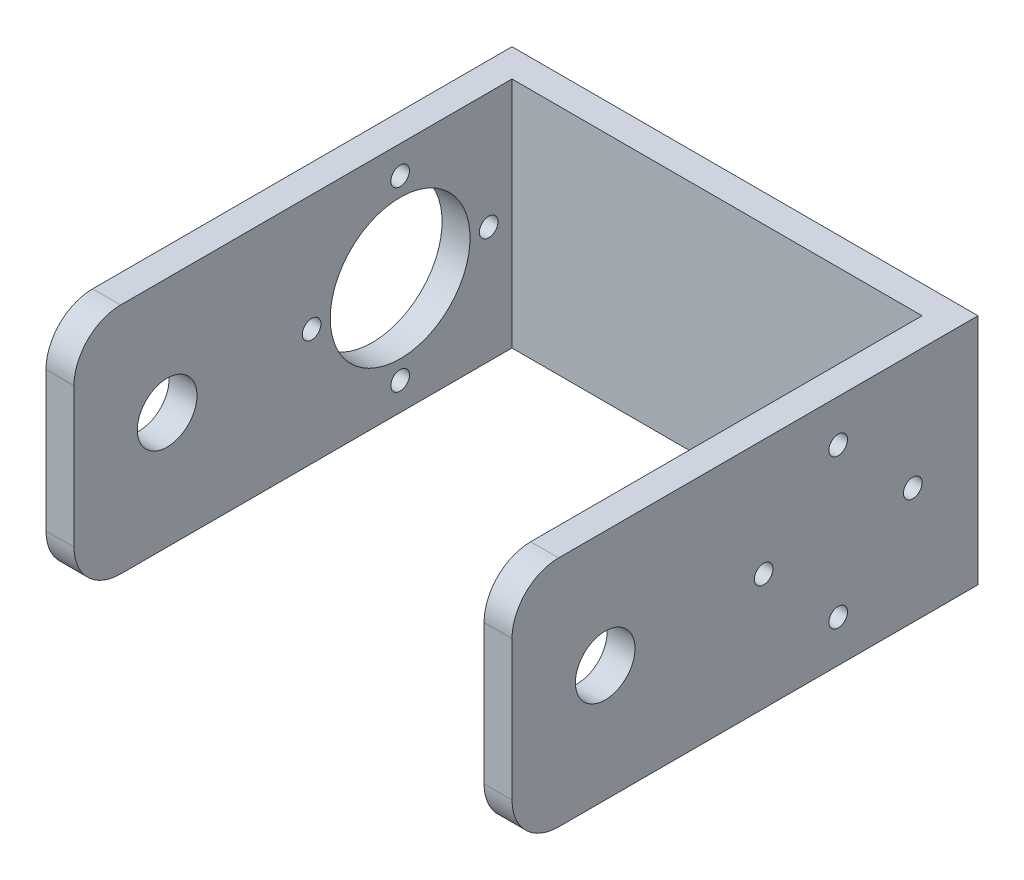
ISO-10303-21;
HEADER;
FILE_DESCRIPTION(('STEP AP214'),'2;1');
FILE_NAME('part.step','',(''),(''),'','','');
FILE_SCHEMA(('AUTOMOTIVE_DESIGN { 1 0 10303 214 1 1 1 1 }'));
ENDSEC;
DATA;
#1=APPLICATION_CONTEXT('core data for automotive mechanical design processes');
#2=APPLICATION_PROTOCOL_DEFINITION('international standard','automotive_design',2000,#1);
#3=PRODUCT_CONTEXT('',#1,'mechanical');
#4=PRODUCT('Part','Part','',(#3));
#5=PRODUCT_RELATED_PRODUCT_CATEGORY('part','',(#4));
#6=PRODUCT_DEFINITION_FORMATION('','',#4);
#7=PRODUCT_DEFINITION_CONTEXT('part definition',#1,'design');
#8=PRODUCT_DEFINITION('design','',#6,#7);
#9=PRODUCT_DEFINITION_SHAPE('','',#8);
#10=(LENGTH_UNIT() NAMED_UNIT(*) SI_UNIT(.MILLI.,.METRE.));
#11=(NAMED_UNIT(*) PLANE_ANGLE_UNIT() SI_UNIT($,.RADIAN.));
#12=(NAMED_UNIT(*) SI_UNIT($,.STERADIAN.) SOLID_ANGLE_UNIT());
#13=UNCERTAINTY_MEASURE_WITH_UNIT(LENGTH_MEASURE(1.E-05),#10,'distance_accuracy_value','');
#14=(GEOMETRIC_REPRESENTATION_CONTEXT(3) GLOBAL_UNCERTAINTY_ASSIGNED_CONTEXT((#13)) GLOBAL_UNIT_ASSIGNED_CONTEXT((#10,
#11,#12)) REPRESENTATION_CONTEXT('',''));
#15=CARTESIAN_POINT('',(0.,0.,0.));
#16=DIRECTION('',(0.,0.,1.));
#17=DIRECTION('',(1.,0.,0.));
#18=AXIS2_PLACEMENT_3D('',#15,#16,#17);
#19=CARTESIAN_POINT('',(27.,25.,-25.));
#20=DIRECTION('',(-1.,0.,0.));
#21=DIRECTION('',(0.,0.,1.));
#22=AXIS2_PLACEMENT_3D('',#19,#20,#21);
#23=PLANE('',#22);
#24=CARTESIAN_POINT('',(27.,20.5,-10.));
#25=DIRECTION('',(1.,0.,0.));
#26=DIRECTION('',(0.,0.,-1.));
#27=AXIS2_PLACEMENT_3D('',#24,#25,#26);
#28=CIRCLE('',#27,1.);
#29=CARTESIAN_POINT('',(27.,20.5,-11.));
#30=VERTEX_POINT('',#29);
#31=EDGE_CURVE('E281',#30,#30,#28,.T.);
#32=ORIENTED_EDGE('',*,*,#31,.F.);
#33=EDGE_LOOP('',(#32));
#34=FACE_BOUND('',#33,.T.);
#35=CARTESIAN_POINT('',(27.,12.5,15.));
#36=DIRECTION('',(1.,0.,0.));
#37=DIRECTION('',(0.,0.,-1.));
#38=AXIS2_PLACEMENT_3D('',#35,#36,#37);
#39=CIRCLE('',#38,3.2);
#40=CARTESIAN_POINT('',(27.,12.5,11.8));
#41=VERTEX_POINT('',#40);
#42=EDGE_CURVE('E286',#41,#41,#39,.T.);
#43=ORIENTED_EDGE('',*,*,#42,.F.);
#44=EDGE_LOOP('',(#43));
#45=FACE_BOUND('',#44,.T.);
#46=CARTESIAN_POINT('',(27.,4.5,-9.99999999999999));
#47=DIRECTION('',(1.,0.,0.));
#48=DIRECTION('',(0.,0.,-1.));
#49=AXIS2_PLACEMENT_3D('',#46,#47,#48);
#50=CIRCLE('',#49,1.);
#51=CARTESIAN_POINT('',(27.,4.5,-11.));
#52=VERTEX_POINT('',#51);
#53=EDGE_CURVE('E285',#52,#52,#50,.T.);
#54=ORIENTED_EDGE('',*,*,#53,.F.);
#55=EDGE_LOOP('',(#54));
#56=FACE_BOUND('',#55,.T.);
#57=CARTESIAN_POINT('',(27.,12.5,-2.));
#58=DIRECTION('',(1.,0.,0.));
#59=DIRECTION('',(0.,0.,-1.));
#60=AXIS2_PLACEMENT_3D('',#57,#58,#59);
#61=CIRCLE('',#60,1.);
#62=CARTESIAN_POINT('',(27.,12.5,-3.));
#63=VERTEX_POINT('',#62);
#64=EDGE_CURVE('E268',#63,#63,#61,.T.);
#65=ORIENTED_EDGE('',*,*,#64,.F.);
#66=EDGE_LOOP('',(#65));
#67=FACE_BOUND('',#66,.T.);
#68=CARTESIAN_POINT('',(27.,12.5,-18.));
#69=DIRECTION('',(1.,0.,0.));
#70=DIRECTION('',(0.,0.,-1.));
#71=AXIS2_PLACEMENT_3D('',#68,#69,#70);
#72=CIRCLE('',#71,1.);
#73=CARTESIAN_POINT('',(27.,12.5,-19.));
#74=VERTEX_POINT('',#73);
#75=EDGE_CURVE('E275',#74,#74,#72,.T.);
#76=ORIENTED_EDGE('',*,*,#75,.F.);
#77=EDGE_LOOP('',(#76));
#78=FACE_BOUND('',#77,.T.);
#79=DIRECTION('',(0.,-1.,0.));
#80=VECTOR('',#79,1.);
#81=CARTESIAN_POINT('',(27.,25.,25.));
#82=LINE('',#81,#80);
#83=CARTESIAN_POINT('',(27.,20.,25.));
#84=VERTEX_POINT('',#83);
#85=CARTESIAN_POINT('',(27.,5.,25.));
#86=VERTEX_POINT('',#85);
#87=EDGE_CURVE('E213',#84,#86,#82,.T.);
#88=ORIENTED_EDGE('',*,*,#87,.T.);
#89=CARTESIAN_POINT('',(27.,5.,20.));
#90=DIRECTION('',(-1.,0.,0.));
#91=DIRECTION('',(0.,0.,1.));
#92=AXIS2_PLACEMENT_3D('',#89,#90,#91);
#93=CIRCLE('',#92,5.);
#94=CARTESIAN_POINT('',(27.,0.,20.));
#95=VERTEX_POINT('',#94);
#96=EDGE_CURVE('E167',#86,#95,#93,.F.);
#97=ORIENTED_EDGE('',*,*,#96,.T.);
#98=DIRECTION('',(0.,0.,-1.));
#99=VECTOR('',#98,1.);
#100=CARTESIAN_POINT('',(27.,0.,-25.));
#101=LINE('',#100,#99);
#102=CARTESIAN_POINT('',(27.,0.,-25.));
#103=VERTEX_POINT('',#102);
#104=EDGE_CURVE('E153',#95,#103,#101,.T.);
#105=ORIENTED_EDGE('',*,*,#104,.T.);
#106=DIRECTION('',(0.,-1.,0.));
#107=VECTOR('',#106,1.);
#108=CARTESIAN_POINT('',(27.,25.,-25.));
#109=LINE('',#108,#107);
#110=CARTESIAN_POINT('',(27.,25.,-25.));
#111=VERTEX_POINT('',#110);
#112=EDGE_CURVE('E145',#111,#103,#109,.T.);
#113=ORIENTED_EDGE('',*,*,#112,.F.);
#114=DIRECTION('',(0.,0.,-1.));
#115=VECTOR('',#114,1.);
#116=CARTESIAN_POINT('',(27.,25.,-25.));
#117=LINE('',#116,#115);
#118=CARTESIAN_POINT('',(27.,25.,20.));
#119=VERTEX_POINT('',#118);
#120=EDGE_CURVE('E129',#119,#111,#117,.T.);
#121=ORIENTED_EDGE('',*,*,#120,.F.);
#122=CARTESIAN_POINT('',(27.,20.,20.));
#123=DIRECTION('',(-1.,0.,0.));
#124=DIRECTION('',(0.,0.,1.));
#125=AXIS2_PLACEMENT_3D('',#122,#123,#124);
#126=CIRCLE('',#125,5.);
#127=EDGE_CURVE('E165',#119,#84,#126,.F.);
#128=ORIENTED_EDGE('',*,*,#127,.T.);
#129=EDGE_LOOP('',(#88,#97,#105,#113,#121,#128));
#130=FACE_BOUND('',#129,.T.);
#131=ADVANCED_FACE('F40',(#34,#45,#56,#67,#78,#130),#23,.F.);
#132=CARTESIAN_POINT('',(-23.,25.,-25.));
#133=DIRECTION('',(0.,0.,1.));
#134=DIRECTION('',(1.,0.,0.));
#135=AXIS2_PLACEMENT_3D('',#132,#133,#134);
#136=PLANE('',#135);
#137=DIRECTION('',(-1.,0.,0.));
#138=VECTOR('',#137,1.);
#139=CARTESIAN_POINT('',(-23.,0.,-25.));
#140=LINE('',#139,#138);
#141=CARTESIAN_POINT('',(-23.,0.,-25.));
#142=VERTEX_POINT('',#141);
#143=EDGE_CURVE('E224',#103,#142,#140,.T.);
#144=ORIENTED_EDGE('',*,*,#143,.T.);
#145=DIRECTION('',(0.,-1.,0.));
#146=VECTOR('',#145,1.);
#147=CARTESIAN_POINT('',(-23.,25.,-25.));
#148=LINE('',#147,#146);
#149=CARTESIAN_POINT('',(-23.,25.,-25.));
#150=VERTEX_POINT('',#149);
#151=EDGE_CURVE('E147',#150,#142,#148,.T.);
#152=ORIENTED_EDGE('',*,*,#151,.F.);
#153=DIRECTION('',(-1.,0.,0.));
#154=VECTOR('',#153,1.);
#155=CARTESIAN_POINT('',(-23.,25.,-25.));
#156=LINE('',#155,#154);
#157=EDGE_CURVE('E134',#111,#150,#156,.T.);
#158=ORIENTED_EDGE('',*,*,#157,.F.);
#159=ORIENTED_EDGE('',*,*,#112,.T.);
#160=EDGE_LOOP('',(#144,#152,#158,#159));
#161=FACE_BOUND('',#160,.T.);
#162=ADVANCED_FACE('F144',(#161),#136,.F.);
#163=CARTESIAN_POINT('',(-23.,25.,25.));
#164=DIRECTION('',(1.,0.,0.));
#165=DIRECTION('',(0.,0.,-1.));
#166=AXIS2_PLACEMENT_3D('',#163,#164,#165);
#167=PLANE('',#166);
#168=CARTESIAN_POINT('',(-23.,12.5,15.));
#169=DIRECTION('',(-1.,0.,0.));
#170=DIRECTION('',(0.,0.,1.));
#171=AXIS2_PLACEMENT_3D('',#168,#169,#170);
#172=CIRCLE('',#171,3.2);
#173=CARTESIAN_POINT('',(-23.,12.5,18.2));
#174=VERTEX_POINT('',#173);
#175=EDGE_CURVE('E242',#174,#174,#172,.T.);
#176=ORIENTED_EDGE('',*,*,#175,.F.);
#177=EDGE_LOOP('',(#176));
#178=FACE_BOUND('',#177,.T.);
#179=CARTESIAN_POINT('',(-23.,22.,-10.));
#180=DIRECTION('',(-1.,0.,0.));
#181=DIRECTION('',(0.,0.,1.));
#182=AXIS2_PLACEMENT_3D('',#179,#180,#181);
#183=CIRCLE('',#182,1.);
#184=CARTESIAN_POINT('',(-23.,22.,-9.));
#185=VERTEX_POINT('',#184);
#186=EDGE_CURVE('E249',#185,#185,#183,.T.);
#187=ORIENTED_EDGE('',*,*,#186,.F.);
#188=EDGE_LOOP('',(#187));
#189=FACE_BOUND('',#188,.T.);
#190=CARTESIAN_POINT('',(-23.,12.5,-0.500000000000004));
#191=DIRECTION('',(-1.,0.,0.));
#192=DIRECTION('',(0.,0.,1.));
#193=AXIS2_PLACEMENT_3D('',#190,#191,#192);
#194=CIRCLE('',#193,1.);
#195=CARTESIAN_POINT('',(-23.,12.5,0.499999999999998));
#196=VERTEX_POINT('',#195);
#197=EDGE_CURVE('E250',#196,#196,#194,.T.);
#198=ORIENTED_EDGE('',*,*,#197,.F.);
#199=EDGE_LOOP('',(#198));
#200=FACE_BOUND('',#199,.T.);
#201=CARTESIAN_POINT('',(-23.,3.,-10.));
#202=DIRECTION('',(-1.,0.,0.));
#203=DIRECTION('',(0.,0.,1.));
#204=AXIS2_PLACEMENT_3D('',#201,#202,#203);
#205=CIRCLE('',#204,1.);
#206=CARTESIAN_POINT('',(-23.,3.,-9.));
#207=VERTEX_POINT('',#206);
#208=EDGE_CURVE('E261',#207,#207,#205,.T.);
#209=ORIENTED_EDGE('',*,*,#208,.F.);
#210=EDGE_LOOP('',(#209));
#211=FACE_BOUND('',#210,.T.);
#212=CARTESIAN_POINT('',(-23.,12.5,-19.5));
#213=DIRECTION('',(-1.,0.,0.));
#214=DIRECTION('',(0.,0.,1.));
#215=AXIS2_PLACEMENT_3D('',#212,#213,#214);
#216=CIRCLE('',#215,1.);
#217=CARTESIAN_POINT('',(-23.,12.5,-18.5));
#218=VERTEX_POINT('',#217);
#219=EDGE_CURVE('E241',#218,#218,#216,.T.);
#220=ORIENTED_EDGE('',*,*,#219,.F.);
#221=EDGE_LOOP('',(#220));
#222=FACE_BOUND('',#221,.T.);
#223=CARTESIAN_POINT('',(-23.,12.5,-10.));
#224=DIRECTION('',(-1.,0.,0.));
#225=DIRECTION('',(0.,0.,1.));
#226=AXIS2_PLACEMENT_3D('',#223,#224,#225);
#227=CIRCLE('',#226,7.5);
#228=CARTESIAN_POINT('',(-23.,12.5,-2.5));
#229=VERTEX_POINT('',#228);
#230=EDGE_CURVE('E234',#229,#229,#227,.T.);
#231=ORIENTED_EDGE('',*,*,#230,.F.);
#232=EDGE_LOOP('',(#231));
#233=FACE_BOUND('',#232,.T.);
#234=DIRECTION('',(0.,0.,1.));
#235=VECTOR('',#234,1.);
#236=CARTESIAN_POINT('',(-23.,0.,25.));
#237=LINE('',#236,#235);
#238=CARTESIAN_POINT('',(-23.,0.,20.));
#239=VERTEX_POINT('',#238);
#240=EDGE_CURVE('E222',#142,#239,#237,.T.);
#241=ORIENTED_EDGE('',*,*,#240,.T.);
#242=CARTESIAN_POINT('',(-23.,5.,20.));
#243=DIRECTION('',(1.,0.,0.));
#244=DIRECTION('',(0.,0.,-1.));
#245=AXIS2_PLACEMENT_3D('',#242,#243,#244);
#246=CIRCLE('',#245,5.);
#247=CARTESIAN_POINT('',(-23.,5.,25.));
#248=VERTEX_POINT('',#247);
#249=EDGE_CURVE('E11',#239,#248,#246,.F.);
#250=ORIENTED_EDGE('',*,*,#249,.T.);
#251=DIRECTION('',(0.,-1.,0.));
#252=VECTOR('',#251,1.);
#253=CARTESIAN_POINT('',(-23.,25.,25.));
#254=LINE('',#253,#252);
#255=CARTESIAN_POINT('',(-23.,20.,25.));
#256=VERTEX_POINT('',#255);
#257=EDGE_CURVE('E159',#256,#248,#254,.T.);
#258=ORIENTED_EDGE('',*,*,#257,.F.);
#259=CARTESIAN_POINT('',(-23.,20.,20.));
#260=DIRECTION('',(1.,0.,0.));
#261=DIRECTION('',(0.,0.,-1.));
#262=AXIS2_PLACEMENT_3D('',#259,#260,#261);
#263=CIRCLE('',#262,5.);
#264=CARTESIAN_POINT('',(-23.,25.,20.));
#265=VERTEX_POINT('',#264);
#266=EDGE_CURVE('E48',#256,#265,#263,.F.);
#267=ORIENTED_EDGE('',*,*,#266,.T.);
#268=DIRECTION('',(0.,0.,1.));
#269=VECTOR('',#268,1.);
#270=CARTESIAN_POINT('',(-23.,25.,25.));
#271=LINE('',#270,#269);
#272=EDGE_CURVE('E149',#150,#265,#271,.T.);
#273=ORIENTED_EDGE('',*,*,#272,.F.);
#274=ORIENTED_EDGE('',*,*,#151,.T.);
#275=EDGE_LOOP('',(#241,#250,#258,#267,#273,#274));
#276=FACE_BOUND('',#275,.T.);
#277=ADVANCED_FACE('F189',(#178,#189,#200,#211,#222,#233,#276),#167,.F.);
#278=CARTESIAN_POINT('',(-20.,25.,25.));
#279=DIRECTION('',(0.,0.,-1.));
#280=DIRECTION('',(-1.,0.,0.));
#281=AXIS2_PLACEMENT_3D('',#278,#279,#280);
#282=PLANE('',#281);
#283=ORIENTED_EDGE('',*,*,#257,.T.);
#284=DIRECTION('',(1.,0.,0.));
#285=VECTOR('',#284,1.);
#286=CARTESIAN_POINT('',(-20.,5.,25.));
#287=LINE('',#286,#285);
#288=CARTESIAN_POINT('',(-20.,5.,25.));
#289=VERTEX_POINT('',#288);
#290=EDGE_CURVE('E182',#248,#289,#287,.T.);
#291=ORIENTED_EDGE('',*,*,#290,.T.);
#292=DIRECTION('',(0.,-1.,0.));
#293=VECTOR('',#292,1.);
#294=CARTESIAN_POINT('',(-20.,25.,25.));
#295=LINE('',#294,#293);
#296=CARTESIAN_POINT('',(-20.,20.,25.));
#297=VERTEX_POINT('',#296);
#298=EDGE_CURVE('E198',#297,#289,#295,.T.);
#299=ORIENTED_EDGE('',*,*,#298,.F.);
#300=DIRECTION('',(1.,0.,0.));
#301=VECTOR('',#300,1.);
#302=CARTESIAN_POINT('',(-20.,20.,25.));
#303=LINE('',#302,#301);
#304=EDGE_CURVE('E60',#297,#256,#303,.F.);
#305=ORIENTED_EDGE('',*,*,#304,.T.);
#306=EDGE_LOOP('',(#283,#291,#299,#305));
#307=FACE_BOUND('',#306,.T.);
#308=ADVANCED_FACE('F200',(#307),#282,.F.);
#309=CARTESIAN_POINT('',(-20.,25.,-22.));
#310=DIRECTION('',(-1.,0.,0.));
#311=DIRECTION('',(0.,0.,1.));
#312=AXIS2_PLACEMENT_3D('',#309,#310,#311);
#313=PLANE('',#312);
#314=CARTESIAN_POINT('',(-20.,12.5,15.));
#315=DIRECTION('',(-1.,0.,0.));
#316=DIRECTION('',(0.,0.,1.));
#317=AXIS2_PLACEMENT_3D('',#314,#315,#316);
#318=CIRCLE('',#317,3.2);
#319=CARTESIAN_POINT('',(-20.,12.5,18.2));
#320=VERTEX_POINT('',#319);
#321=EDGE_CURVE('E238',#320,#320,#318,.F.);
#322=ORIENTED_EDGE('',*,*,#321,.F.);
#323=EDGE_LOOP('',(#322));
#324=FACE_BOUND('',#323,.T.);
#325=CARTESIAN_POINT('',(-20.,22.,-10.));
#326=DIRECTION('',(-1.,0.,0.));
#327=DIRECTION('',(0.,0.,1.));
#328=AXIS2_PLACEMENT_3D('',#325,#326,#327);
#329=CIRCLE('',#328,1.);
#330=CARTESIAN_POINT('',(-20.,22.,-9.));
#331=VERTEX_POINT('',#330);
#332=EDGE_CURVE('E237',#331,#331,#329,.F.);
#333=ORIENTED_EDGE('',*,*,#332,.F.);
#334=EDGE_LOOP('',(#333));
#335=FACE_BOUND('',#334,.T.);
#336=CARTESIAN_POINT('',(-20.,12.5,-0.500000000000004));
#337=DIRECTION('',(-1.,0.,0.));
#338=DIRECTION('',(0.,0.,1.));
#339=AXIS2_PLACEMENT_3D('',#336,#337,#338);
#340=CIRCLE('',#339,1.);
#341=CARTESIAN_POINT('',(-20.,12.5,0.499999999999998));
#342=VERTEX_POINT('',#341);
#343=EDGE_CURVE('E246',#342,#342,#340,.F.);
#344=ORIENTED_EDGE('',*,*,#343,.F.);
#345=EDGE_LOOP('',(#344));
#346=FACE_BOUND('',#345,.T.);
#347=CARTESIAN_POINT('',(-20.,3.,-10.));
#348=DIRECTION('',(-1.,0.,0.));
#349=DIRECTION('',(0.,0.,1.));
#350=AXIS2_PLACEMENT_3D('',#347,#348,#349);
#351=CIRCLE('',#350,1.);
#352=CARTESIAN_POINT('',(-20.,3.,-9.));
#353=VERTEX_POINT('',#352);
#354=EDGE_CURVE('E253',#353,#353,#351,.F.);
#355=ORIENTED_EDGE('',*,*,#354,.F.);
#356=EDGE_LOOP('',(#355));
#357=FACE_BOUND('',#356,.T.);
#358=CARTESIAN_POINT('',(-20.,12.5,-19.5));
#359=DIRECTION('',(-1.,0.,0.));
#360=DIRECTION('',(0.,0.,1.));
#361=AXIS2_PLACEMENT_3D('',#358,#359,#360);
#362=CIRCLE('',#361,1.);
#363=CARTESIAN_POINT('',(-20.,12.5,-18.5));
#364=VERTEX_POINT('',#363);
#365=EDGE_CURVE('E258',#364,#364,#362,.F.);
#366=ORIENTED_EDGE('',*,*,#365,.F.);
#367=EDGE_LOOP('',(#366));
#368=FACE_BOUND('',#367,.T.);
#369=CARTESIAN_POINT('',(-20.,12.5,-10.));
#370=DIRECTION('',(-1.,0.,0.));
#371=DIRECTION('',(0.,0.,1.));
#372=AXIS2_PLACEMENT_3D('',#369,#370,#371);
#373=CIRCLE('',#372,7.5);
#374=CARTESIAN_POINT('',(-20.,12.5,-2.5));
#375=VERTEX_POINT('',#374);
#376=EDGE_CURVE('E227',#375,#375,#373,.F.);
#377=ORIENTED_EDGE('',*,*,#376,.F.);
#378=EDGE_LOOP('',(#377));
#379=FACE_BOUND('',#378,.T.);
#380=ORIENTED_EDGE('',*,*,#298,.T.);
#381=CARTESIAN_POINT('',(-20.,5.,20.));
#382=DIRECTION('',(-1.,0.,0.));
#383=DIRECTION('',(0.,0.,1.));
#384=AXIS2_PLACEMENT_3D('',#381,#382,#383);
#385=CIRCLE('',#384,5.);
#386=CARTESIAN_POINT('',(-20.,0.,20.));
#387=VERTEX_POINT('',#386);
#388=EDGE_CURVE('E187',#289,#387,#385,.F.);
#389=ORIENTED_EDGE('',*,*,#388,.T.);
#390=DIRECTION('',(0.,0.,-1.));
#391=VECTOR('',#390,1.);
#392=CARTESIAN_POINT('',(-20.,0.,-22.));
#393=LINE('',#392,#391);
#394=CARTESIAN_POINT('',(-20.,0.,-22.));
#395=VERTEX_POINT('',#394);
#396=EDGE_CURVE('E220',#387,#395,#393,.T.);
#397=ORIENTED_EDGE('',*,*,#396,.T.);
#398=DIRECTION('',(0.,-1.,0.));
#399=VECTOR('',#398,1.);
#400=CARTESIAN_POINT('',(-20.,25.,-22.));
#401=LINE('',#400,#399);
#402=CARTESIAN_POINT('',(-20.,25.,-22.));
#403=VERTEX_POINT('',#402);
#404=EDGE_CURVE('E202',#403,#395,#401,.T.);
#405=ORIENTED_EDGE('',*,*,#404,.F.);
#406=DIRECTION('',(0.,0.,-1.));
#407=VECTOR('',#406,1.);
#408=CARTESIAN_POINT('',(-20.,25.,-22.));
#409=LINE('',#408,#407);
#410=CARTESIAN_POINT('',(-20.,25.,20.));
#411=VERTEX_POINT('',#410);
#412=EDGE_CURVE('E193',#411,#403,#409,.T.);
#413=ORIENTED_EDGE('',*,*,#412,.F.);
#414=CARTESIAN_POINT('',(-20.,20.,20.));
#415=DIRECTION('',(-1.,0.,0.));
#416=DIRECTION('',(0.,0.,1.));
#417=AXIS2_PLACEMENT_3D('',#414,#415,#416);
#418=CIRCLE('',#417,5.);
#419=EDGE_CURVE('E185',#411,#297,#418,.F.);
#420=ORIENTED_EDGE('',*,*,#419,.T.);
#421=EDGE_LOOP('',(#380,#389,#397,#405,#413,#420));
#422=FACE_BOUND('',#421,.T.);
#423=ADVANCED_FACE('F197',(#324,#335,#346,#357,#368,#379,#422),#313,.F.);
#424=CARTESIAN_POINT('',(24.,25.,-22.));
#425=DIRECTION('',(0.,0.,-1.));
#426=DIRECTION('',(-1.,0.,0.));
#427=AXIS2_PLACEMENT_3D('',#424,#425,#426);
#428=PLANE('',#427);
#429=DIRECTION('',(1.,0.,0.));
#430=VECTOR('',#429,1.);
#431=CARTESIAN_POINT('',(24.,0.,-22.));
#432=LINE('',#431,#430);
#433=CARTESIAN_POINT('',(24.,0.,-22.));
#434=VERTEX_POINT('',#433);
#435=EDGE_CURVE('E218',#395,#434,#432,.T.);
#436=ORIENTED_EDGE('',*,*,#435,.T.);
#437=DIRECTION('',(0.,-1.,0.));
#438=VECTOR('',#437,1.);
#439=CARTESIAN_POINT('',(24.,25.,-22.));
#440=LINE('',#439,#438);
#441=CARTESIAN_POINT('',(24.,25.,-22.));
#442=VERTEX_POINT('',#441);
#443=EDGE_CURVE('E205',#442,#434,#440,.T.);
#444=ORIENTED_EDGE('',*,*,#443,.F.);
#445=DIRECTION('',(1.,0.,0.));
#446=VECTOR('',#445,1.);
#447=CARTESIAN_POINT('',(24.,25.,-22.));
#448=LINE('',#447,#446);
#449=EDGE_CURVE('E229',#403,#442,#448,.T.);
#450=ORIENTED_EDGE('',*,*,#449,.F.);
#451=ORIENTED_EDGE('',*,*,#404,.T.);
#452=EDGE_LOOP('',(#436,#444,#450,#451));
#453=FACE_BOUND('',#452,.T.);
#454=ADVANCED_FACE('F304',(#453),#428,.F.);
#455=CARTESIAN_POINT('',(24.,25.,25.));
#456=DIRECTION('',(1.,0.,0.));
#457=DIRECTION('',(0.,0.,-1.));
#458=AXIS2_PLACEMENT_3D('',#455,#456,#457);
#459=PLANE('',#458);
#460=CARTESIAN_POINT('',(24.,20.5,-10.));
#461=DIRECTION('',(1.,0.,0.));
#462=DIRECTION('',(0.,0.,-1.));
#463=AXIS2_PLACEMENT_3D('',#460,#461,#462);
#464=CIRCLE('',#463,1.);
#465=CARTESIAN_POINT('',(24.,20.5,-11.));
#466=VERTEX_POINT('',#465);
#467=EDGE_CURVE('E245',#466,#466,#464,.F.);
#468=ORIENTED_EDGE('',*,*,#467,.F.);
#469=EDGE_LOOP('',(#468));
#470=FACE_BOUND('',#469,.T.);
#471=CARTESIAN_POINT('',(24.,12.5,15.));
#472=DIRECTION('',(1.,0.,0.));
#473=DIRECTION('',(0.,0.,-1.));
#474=AXIS2_PLACEMENT_3D('',#471,#472,#473);
#475=CIRCLE('',#474,3.2);
#476=CARTESIAN_POINT('',(24.,12.5,11.8));
#477=VERTEX_POINT('',#476);
#478=EDGE_CURVE('E282',#477,#477,#475,.F.);
#479=ORIENTED_EDGE('',*,*,#478,.F.);
#480=EDGE_LOOP('',(#479));
#481=FACE_BOUND('',#480,.T.);
#482=CARTESIAN_POINT('',(24.,4.5,-9.99999999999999));
#483=DIRECTION('',(1.,0.,0.));
#484=DIRECTION('',(0.,0.,-1.));
#485=AXIS2_PLACEMENT_3D('',#482,#483,#484);
#486=CIRCLE('',#485,1.);
#487=CARTESIAN_POINT('',(24.,4.5,-11.));
#488=VERTEX_POINT('',#487);
#489=EDGE_CURVE('E272',#488,#488,#486,.F.);
#490=ORIENTED_EDGE('',*,*,#489,.F.);
#491=EDGE_LOOP('',(#490));
#492=FACE_BOUND('',#491,.T.);
#493=CARTESIAN_POINT('',(24.,12.5,-2.));
#494=DIRECTION('',(1.,0.,0.));
#495=DIRECTION('',(0.,0.,-1.));
#496=AXIS2_PLACEMENT_3D('',#493,#494,#495);
#497=CIRCLE('',#496,1.);
#498=CARTESIAN_POINT('',(24.,12.5,-3.));
#499=VERTEX_POINT('',#498);
#500=EDGE_CURVE('E271',#499,#499,#497,.F.);
#501=ORIENTED_EDGE('',*,*,#500,.F.);
#502=EDGE_LOOP('',(#501));
#503=FACE_BOUND('',#502,.T.);
#504=CARTESIAN_POINT('',(24.,12.5,-18.));
#505=DIRECTION('',(1.,0.,0.));
#506=DIRECTION('',(0.,0.,-1.));
#507=AXIS2_PLACEMENT_3D('',#504,#505,#506);
#508=CIRCLE('',#507,1.);
#509=CARTESIAN_POINT('',(24.,12.5,-19.));
#510=VERTEX_POINT('',#509);
#511=EDGE_CURVE('E278',#510,#510,#508,.F.);
#512=ORIENTED_EDGE('',*,*,#511,.F.);
#513=EDGE_LOOP('',(#512));
#514=FACE_BOUND('',#513,.T.);
#515=DIRECTION('',(0.,0.,1.));
#516=VECTOR('',#515,1.);
#517=CARTESIAN_POINT('',(24.,0.,25.));
#518=LINE('',#517,#516);
#519=CARTESIAN_POINT('',(24.,0.,20.));
#520=VERTEX_POINT('',#519);
#521=EDGE_CURVE('E140',#434,#520,#518,.T.);
#522=ORIENTED_EDGE('',*,*,#521,.T.);
#523=CARTESIAN_POINT('',(24.,5.,20.));
#524=DIRECTION('',(1.,0.,0.));
#525=DIRECTION('',(0.,0.,-1.));
#526=AXIS2_PLACEMENT_3D('',#523,#524,#525);
#527=CIRCLE('',#526,5.);
#528=CARTESIAN_POINT('',(24.,5.,25.));
#529=VERTEX_POINT('',#528);
#530=EDGE_CURVE('E175',#520,#529,#527,.F.);
#531=ORIENTED_EDGE('',*,*,#530,.T.);
#532=DIRECTION('',(0.,-1.,0.));
#533=VECTOR('',#532,1.);
#534=CARTESIAN_POINT('',(24.,25.,25.));
#535=LINE('',#534,#533);
#536=CARTESIAN_POINT('',(24.,20.,25.));
#537=VERTEX_POINT('',#536);
#538=EDGE_CURVE('E210',#537,#529,#535,.T.);
#539=ORIENTED_EDGE('',*,*,#538,.F.);
#540=CARTESIAN_POINT('',(24.,20.,20.));
#541=DIRECTION('',(1.,0.,0.));
#542=DIRECTION('',(0.,0.,-1.));
#543=AXIS2_PLACEMENT_3D('',#540,#541,#542);
#544=CIRCLE('',#543,5.);
#545=CARTESIAN_POINT('',(24.,25.,20.));
#546=VERTEX_POINT('',#545);
#547=EDGE_CURVE('E173',#537,#546,#544,.F.);
#548=ORIENTED_EDGE('',*,*,#547,.T.);
#549=DIRECTION('',(0.,0.,1.));
#550=VECTOR('',#549,1.);
#551=CARTESIAN_POINT('',(24.,25.,25.));
#552=LINE('',#551,#550);
#553=EDGE_CURVE('E215',#442,#546,#552,.T.);
#554=ORIENTED_EDGE('',*,*,#553,.F.);
#555=ORIENTED_EDGE('',*,*,#443,.T.);
#556=EDGE_LOOP('',(#522,#531,#539,#548,#554,#555));
#557=FACE_BOUND('',#556,.T.);
#558=ADVANCED_FACE('F300',(#470,#481,#492,#503,#514,#557),#459,.F.);
#559=CARTESIAN_POINT('',(27.,25.,25.));
#560=DIRECTION('',(0.,0.,-1.));
#561=DIRECTION('',(-1.,0.,0.));
#562=AXIS2_PLACEMENT_3D('',#559,#560,#561);
#563=PLANE('',#562);
#564=ORIENTED_EDGE('',*,*,#538,.T.);
#565=DIRECTION('',(1.,0.,0.));
#566=VECTOR('',#565,1.);
#567=CARTESIAN_POINT('',(27.,5.,25.));
#568=LINE('',#567,#566);
#569=EDGE_CURVE('E157',#529,#86,#568,.T.);
#570=ORIENTED_EDGE('',*,*,#569,.T.);
#571=ORIENTED_EDGE('',*,*,#87,.F.);
#572=DIRECTION('',(1.,0.,0.));
#573=VECTOR('',#572,1.);
#574=CARTESIAN_POINT('',(27.,20.,25.));
#575=LINE('',#574,#573);
#576=EDGE_CURVE('E155',#84,#537,#575,.F.);
#577=ORIENTED_EDGE('',*,*,#576,.T.);
#578=EDGE_LOOP('',(#564,#570,#571,#577));
#579=FACE_BOUND('',#578,.T.);
#580=ADVANCED_FACE('F303',(#579),#563,.F.);
#581=CARTESIAN_POINT('',(0.,25.,0.));
#582=DIRECTION('',(0.,-1.,0.));
#583=DIRECTION('',(0.,0.,-1.));
#584=AXIS2_PLACEMENT_3D('',#581,#582,#583);
#585=PLANE('',#584);
#586=ORIENTED_EDGE('',*,*,#553,.T.);
#587=DIRECTION('',(1.,0.,0.));
#588=VECTOR('',#587,1.);
#589=CARTESIAN_POINT('',(0.,25.,20.));
#590=LINE('',#589,#588);
#591=EDGE_CURVE('E137',#546,#119,#590,.T.);
#592=ORIENTED_EDGE('',*,*,#591,.T.);
#593=ORIENTED_EDGE('',*,*,#120,.T.);
#594=ORIENTED_EDGE('',*,*,#157,.T.);
#595=ORIENTED_EDGE('',*,*,#272,.T.);
#596=DIRECTION('',(1.,0.,0.));
#597=VECTOR('',#596,1.);
#598=CARTESIAN_POINT('',(0.,25.,20.));
#599=LINE('',#598,#597);
#600=EDGE_CURVE('E177',#265,#411,#599,.T.);
#601=ORIENTED_EDGE('',*,*,#600,.T.);
#602=ORIENTED_EDGE('',*,*,#412,.T.);
#603=ORIENTED_EDGE('',*,*,#449,.T.);
#604=EDGE_LOOP('',(#586,#592,#593,#594,#595,#601,#602,#603));
#605=FACE_BOUND('',#604,.T.);
#606=ADVANCED_FACE('F132',(#605),#585,.F.);
#607=CARTESIAN_POINT('',(0.,0.,0.));
#608=DIRECTION('',(0.,-1.,0.));
#609=DIRECTION('',(0.,0.,-1.));
#610=AXIS2_PLACEMENT_3D('',#607,#608,#609);
#611=PLANE('',#610);
#612=ORIENTED_EDGE('',*,*,#104,.F.);
#613=DIRECTION('',(1.,0.,0.));
#614=VECTOR('',#613,1.);
#615=CARTESIAN_POINT('',(24.,0.,20.));
#616=LINE('',#615,#614);
#617=EDGE_CURVE('E171',#95,#520,#616,.F.);
#618=ORIENTED_EDGE('',*,*,#617,.T.);
#619=ORIENTED_EDGE('',*,*,#521,.F.);
#620=ORIENTED_EDGE('',*,*,#435,.F.);
#621=ORIENTED_EDGE('',*,*,#396,.F.);
#622=DIRECTION('',(1.,0.,0.));
#623=VECTOR('',#622,1.);
#624=CARTESIAN_POINT('',(-23.,0.,20.));
#625=LINE('',#624,#623);
#626=EDGE_CURVE('E169',#387,#239,#625,.F.);
#627=ORIENTED_EDGE('',*,*,#626,.T.);
#628=ORIENTED_EDGE('',*,*,#240,.F.);
#629=ORIENTED_EDGE('',*,*,#143,.F.);
#630=EDGE_LOOP('',(#612,#618,#619,#620,#621,#627,#628,#629));
#631=FACE_BOUND('',#630,.T.);
#632=ADVANCED_FACE('F334',(#631),#611,.T.);
#633=CARTESIAN_POINT('',(27.001,12.5,-10.));
#634=DIRECTION('',(-1.,0.,0.));
#635=DIRECTION('',(0.,0.,1.));
#636=AXIS2_PLACEMENT_3D('',#633,#634,#635);
#637=CYLINDRICAL_SURFACE('',#636,7.5);
#638=ORIENTED_EDGE('',*,*,#230,.T.);
#639=EDGE_LOOP('',(#638));
#640=FACE_BOUND('',#639,.T.);
#641=ORIENTED_EDGE('',*,*,#376,.T.);
#642=EDGE_LOOP('',(#641));
#643=FACE_BOUND('',#642,.T.);
#644=ADVANCED_FACE('F390',(#640,#643),#637,.F.);
#645=CARTESIAN_POINT('',(27.001,12.5,-19.5));
#646=DIRECTION('',(-1.,0.,0.));
#647=DIRECTION('',(0.,0.,1.));
#648=AXIS2_PLACEMENT_3D('',#645,#646,#647);
#649=CYLINDRICAL_SURFACE('',#648,1.);
#650=ORIENTED_EDGE('',*,*,#219,.T.);
#651=EDGE_LOOP('',(#650));
#652=FACE_BOUND('',#651,.T.);
#653=ORIENTED_EDGE('',*,*,#365,.T.);
#654=EDGE_LOOP('',(#653));
#655=FACE_BOUND('',#654,.T.);
#656=ADVANCED_FACE('F386',(#652,#655),#649,.F.);
#657=CARTESIAN_POINT('',(27.001,3.,-10.));
#658=DIRECTION('',(-1.,0.,0.));
#659=DIRECTION('',(0.,0.,1.));
#660=AXIS2_PLACEMENT_3D('',#657,#658,#659);
#661=CYLINDRICAL_SURFACE('',#660,1.);
#662=ORIENTED_EDGE('',*,*,#208,.T.);
#663=EDGE_LOOP('',(#662));
#664=FACE_BOUND('',#663,.T.);
#665=ORIENTED_EDGE('',*,*,#354,.T.);
#666=EDGE_LOOP('',(#665));
#667=FACE_BOUND('',#666,.T.);
#668=ADVANCED_FACE('F382',(#664,#667),#661,.F.);
#669=CARTESIAN_POINT('',(27.001,12.5,-0.500000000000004));
#670=DIRECTION('',(-1.,0.,0.));
#671=DIRECTION('',(0.,0.,1.));
#672=AXIS2_PLACEMENT_3D('',#669,#670,#671);
#673=CYLINDRICAL_SURFACE('',#672,1.);
#674=ORIENTED_EDGE('',*,*,#197,.T.);
#675=EDGE_LOOP('',(#674));
#676=FACE_BOUND('',#675,.T.);
#677=ORIENTED_EDGE('',*,*,#343,.T.);
#678=EDGE_LOOP('',(#677));
#679=FACE_BOUND('',#678,.T.);
#680=ADVANCED_FACE('F385',(#676,#679),#673,.F.);
#681=CARTESIAN_POINT('',(27.001,22.,-10.));
#682=DIRECTION('',(-1.,0.,0.));
#683=DIRECTION('',(0.,0.,1.));
#684=AXIS2_PLACEMENT_3D('',#681,#682,#683);
#685=CYLINDRICAL_SURFACE('',#684,1.);
#686=ORIENTED_EDGE('',*,*,#186,.T.);
#687=EDGE_LOOP('',(#686));
#688=FACE_BOUND('',#687,.T.);
#689=ORIENTED_EDGE('',*,*,#332,.T.);
#690=EDGE_LOOP('',(#689));
#691=FACE_BOUND('',#690,.T.);
#692=ADVANCED_FACE('F392',(#688,#691),#685,.F.);
#693=CARTESIAN_POINT('',(27.001,12.5,15.));
#694=DIRECTION('',(-1.,0.,0.));
#695=DIRECTION('',(0.,0.,1.));
#696=AXIS2_PLACEMENT_3D('',#693,#694,#695);
#697=CYLINDRICAL_SURFACE('',#696,3.2);
#698=ORIENTED_EDGE('',*,*,#175,.T.);
#699=EDGE_LOOP('',(#698));
#700=FACE_BOUND('',#699,.T.);
#701=ORIENTED_EDGE('',*,*,#321,.T.);
#702=EDGE_LOOP('',(#701));
#703=FACE_BOUND('',#702,.T.);
#704=ADVANCED_FACE('F377',(#700,#703),#697,.F.);
#705=CARTESIAN_POINT('',(-23.001,12.5,-18.));
#706=DIRECTION('',(1.,0.,0.));
#707=DIRECTION('',(0.,0.,-1.));
#708=AXIS2_PLACEMENT_3D('',#705,#706,#707);
#709=CYLINDRICAL_SURFACE('',#708,1.);
#710=ORIENTED_EDGE('',*,*,#75,.T.);
#711=EDGE_LOOP('',(#710));
#712=FACE_BOUND('',#711,.T.);
#713=ORIENTED_EDGE('',*,*,#511,.T.);
#714=EDGE_LOOP('',(#713));
#715=FACE_BOUND('',#714,.T.);
#716=ADVANCED_FACE('F374',(#712,#715),#709,.F.);
#717=CARTESIAN_POINT('',(-23.001,12.5,-1.99999999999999));
#718=DIRECTION('',(1.,0.,0.));
#719=DIRECTION('',(0.,0.,-1.));
#720=AXIS2_PLACEMENT_3D('',#717,#718,#719);
#721=CYLINDRICAL_SURFACE('',#720,1.);
#722=ORIENTED_EDGE('',*,*,#64,.T.);
#723=EDGE_LOOP('',(#722));
#724=FACE_BOUND('',#723,.T.);
#725=ORIENTED_EDGE('',*,*,#500,.T.);
#726=EDGE_LOOP('',(#725));
#727=FACE_BOUND('',#726,.T.);
#728=ADVANCED_FACE('F371',(#724,#727),#721,.F.);
#729=CARTESIAN_POINT('',(-23.001,4.5,-9.99999999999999));
#730=DIRECTION('',(1.,0.,0.));
#731=DIRECTION('',(0.,0.,-1.));
#732=AXIS2_PLACEMENT_3D('',#729,#730,#731);
#733=CYLINDRICAL_SURFACE('',#732,1.);
#734=ORIENTED_EDGE('',*,*,#53,.T.);
#735=EDGE_LOOP('',(#734));
#736=FACE_BOUND('',#735,.T.);
#737=ORIENTED_EDGE('',*,*,#489,.T.);
#738=EDGE_LOOP('',(#737));
#739=FACE_BOUND('',#738,.T.);
#740=ADVANCED_FACE('F366',(#736,#739),#733,.F.);
#741=CARTESIAN_POINT('',(-23.001,12.5,15.));
#742=DIRECTION('',(1.,0.,0.));
#743=DIRECTION('',(0.,0.,-1.));
#744=AXIS2_PLACEMENT_3D('',#741,#742,#743);
#745=CYLINDRICAL_SURFACE('',#744,3.2);
#746=ORIENTED_EDGE('',*,*,#42,.T.);
#747=EDGE_LOOP('',(#746));
#748=FACE_BOUND('',#747,.T.);
#749=ORIENTED_EDGE('',*,*,#478,.T.);
#750=EDGE_LOOP('',(#749));
#751=FACE_BOUND('',#750,.T.);
#752=ADVANCED_FACE('F360',(#748,#751),#745,.F.);
#753=CARTESIAN_POINT('',(-23.001,20.5,-9.99999999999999));
#754=DIRECTION('',(1.,0.,0.));
#755=DIRECTION('',(0.,0.,-1.));
#756=AXIS2_PLACEMENT_3D('',#753,#754,#755);
#757=CYLINDRICAL_SURFACE('',#756,1.);
#758=ORIENTED_EDGE('',*,*,#31,.T.);
#759=EDGE_LOOP('',(#758));
#760=FACE_BOUND('',#759,.T.);
#761=ORIENTED_EDGE('',*,*,#467,.T.);
#762=EDGE_LOOP('',(#761));
#763=FACE_BOUND('',#762,.T.);
#764=ADVANCED_FACE('F298',(#760,#763),#757,.F.);
#765=CARTESIAN_POINT('',(27.,5.,20.));
#766=DIRECTION('',(-1.,0.,0.));
#767=DIRECTION('',(0.,0.,1.));
#768=AXIS2_PLACEMENT_3D('',#765,#766,#767);
#769=CYLINDRICAL_SURFACE('',#768,5.);
#770=ORIENTED_EDGE('',*,*,#530,.F.);
#771=ORIENTED_EDGE('',*,*,#617,.F.);
#772=ORIENTED_EDGE('',*,*,#96,.F.);
#773=ORIENTED_EDGE('',*,*,#569,.F.);
#774=EDGE_LOOP('',(#770,#771,#772,#773));
#775=FACE_BOUND('',#774,.T.);
#776=ADVANCED_FACE('F324',(#775),#769,.T.);
#777=CARTESIAN_POINT('',(0.,20.,20.));
#778=DIRECTION('',(1.,0.,0.));
#779=DIRECTION('',(0.,0.,-1.));
#780=AXIS2_PLACEMENT_3D('',#777,#778,#779);
#781=CYLINDRICAL_SURFACE('',#780,5.);
#782=ORIENTED_EDGE('',*,*,#547,.F.);
#783=ORIENTED_EDGE('',*,*,#576,.F.);
#784=ORIENTED_EDGE('',*,*,#127,.F.);
#785=ORIENTED_EDGE('',*,*,#591,.F.);
#786=EDGE_LOOP('',(#782,#783,#784,#785));
#787=FACE_BOUND('',#786,.T.);
#788=ADVANCED_FACE('F330',(#787),#781,.T.);
#789=CARTESIAN_POINT('',(-20.,5.,20.));
#790=DIRECTION('',(-1.,0.,0.));
#791=DIRECTION('',(0.,0.,1.));
#792=AXIS2_PLACEMENT_3D('',#789,#790,#791);
#793=CYLINDRICAL_SURFACE('',#792,5.);
#794=ORIENTED_EDGE('',*,*,#249,.F.);
#795=ORIENTED_EDGE('',*,*,#626,.F.);
#796=ORIENTED_EDGE('',*,*,#388,.F.);
#797=ORIENTED_EDGE('',*,*,#290,.F.);
#798=EDGE_LOOP('',(#794,#795,#796,#797));
#799=FACE_BOUND('',#798,.T.);
#800=ADVANCED_FACE('F338',(#799),#793,.T.);
#801=CARTESIAN_POINT('',(0.,20.,20.));
#802=DIRECTION('',(1.,0.,0.));
#803=DIRECTION('',(0.,0.,-1.));
#804=AXIS2_PLACEMENT_3D('',#801,#802,#803);
#805=CYLINDRICAL_SURFACE('',#804,5.);
#806=ORIENTED_EDGE('',*,*,#266,.F.);
#807=ORIENTED_EDGE('',*,*,#304,.F.);
#808=ORIENTED_EDGE('',*,*,#419,.F.);
#809=ORIENTED_EDGE('',*,*,#600,.F.);
#810=EDGE_LOOP('',(#806,#807,#808,#809));
#811=FACE_BOUND('',#810,.T.);
#812=ADVANCED_FACE('F42',(#811),#805,.T.);
#813=CLOSED_SHELL('',(#131,#162,#277,#308,#423,#454,#558,#580,#606,#632,#644,#656,#668,#680,
#692,#704,#716,#728,#740,#752,#764,#776,#788,#800,#812));
#814=MANIFOLD_SOLID_BREP('B2',#813);
#815=ADVANCED_BREP_SHAPE_REPRESENTATION('',(#18,#814),#14);
#816=SHAPE_DEFINITION_REPRESENTATION(#9,#815);
ENDSEC;
END-ISO-10303-21;
